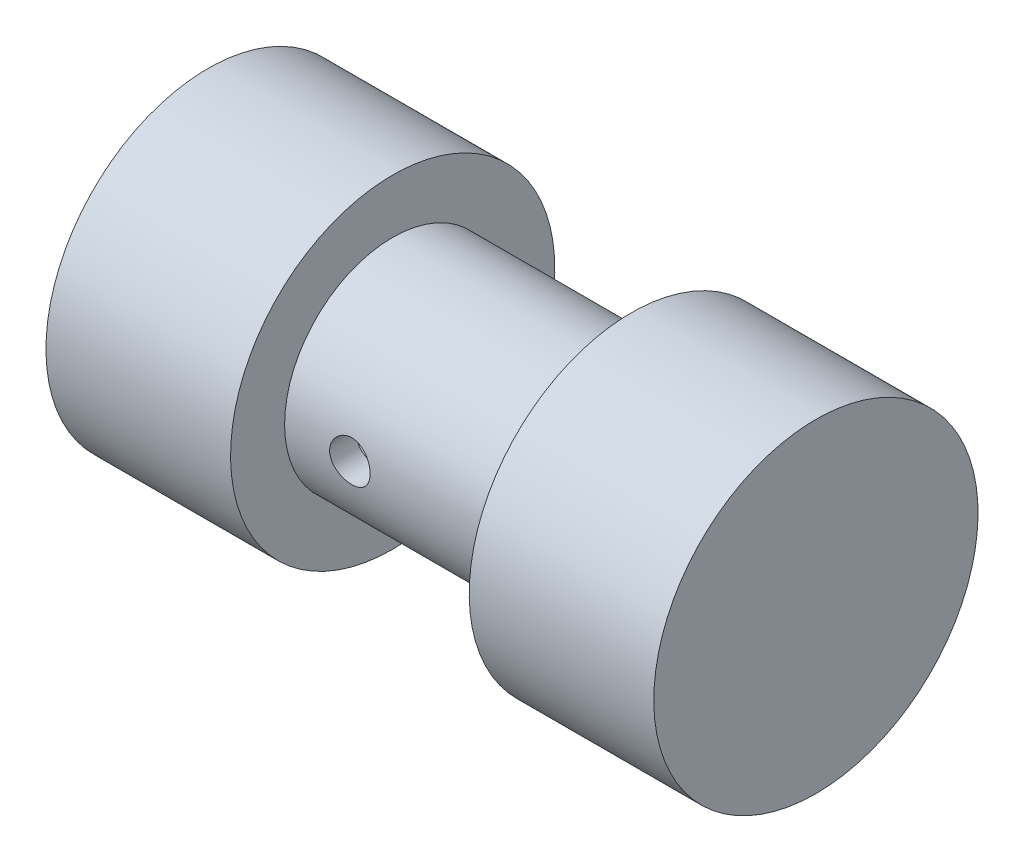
ISO-10303-21;
HEADER;
FILE_DESCRIPTION(('STEP AP214'),'2;1');
FILE_NAME('part.step','',(''),(''),'','','');
FILE_SCHEMA(('AUTOMOTIVE_DESIGN { 1 0 10303 214 1 1 1 1 }'));
ENDSEC;
DATA;
#1=APPLICATION_CONTEXT('core data for automotive mechanical design processes');
#2=APPLICATION_PROTOCOL_DEFINITION('international standard','automotive_design',2000,#1);
#3=PRODUCT_CONTEXT('',#1,'mechanical');
#4=PRODUCT('Part','Part','',(#3));
#5=PRODUCT_RELATED_PRODUCT_CATEGORY('part','',(#4));
#6=PRODUCT_DEFINITION_FORMATION('','',#4);
#7=PRODUCT_DEFINITION_CONTEXT('part definition',#1,'design');
#8=PRODUCT_DEFINITION('design','',#6,#7);
#9=PRODUCT_DEFINITION_SHAPE('','',#8);
#10=(LENGTH_UNIT() NAMED_UNIT(*) SI_UNIT(.MILLI.,.METRE.));
#11=(NAMED_UNIT(*) PLANE_ANGLE_UNIT() SI_UNIT($,.RADIAN.));
#12=(NAMED_UNIT(*) SI_UNIT($,.STERADIAN.) SOLID_ANGLE_UNIT());
#13=UNCERTAINTY_MEASURE_WITH_UNIT(LENGTH_MEASURE(1.E-05),#10,'distance_accuracy_value','');
#14=(GEOMETRIC_REPRESENTATION_CONTEXT(3) GLOBAL_UNCERTAINTY_ASSIGNED_CONTEXT((#13)) GLOBAL_UNIT_ASSIGNED_CONTEXT((#10,
#11,#12)) REPRESENTATION_CONTEXT('',''));
#15=CARTESIAN_POINT('',(0.,0.,0.));
#16=DIRECTION('',(0.,0.,1.));
#17=DIRECTION('',(1.,0.,0.));
#18=AXIS2_PLACEMENT_3D('',#15,#16,#17);
#19=CARTESIAN_POINT('',(0.,0.,0.));
#20=DIRECTION('',(-1.,0.,0.));
#21=DIRECTION('',(0.,-1.,0.));
#22=AXIS2_PLACEMENT_3D('',#19,#20,#21);
#23=CYLINDRICAL_SURFACE('',#22,4.7625);
#24=CARTESIAN_POINT('',(-1.984375,0.,-4.7625));
#25=CARTESIAN_POINT('',(-1.98437684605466,-0.065782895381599,-4.76249888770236));
#26=CARTESIAN_POINT('',(-1.98984516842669,-0.131586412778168,-4.76112346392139));
#27=CARTESIAN_POINT('',(-2.01154121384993,-0.26130751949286,-4.75576990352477));
#28=CARTESIAN_POINT('',(-2.02777503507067,-0.325224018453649,-4.751790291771));
#29=CARTESIAN_POINT('',(-2.07044865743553,-0.44927906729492,-4.74166903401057));
#30=CARTESIAN_POINT('',(-2.09687620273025,-0.509422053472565,-4.73552998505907));
#31=CARTESIAN_POINT('',(-2.15914397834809,-0.624421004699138,-4.72174366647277));
#32=CARTESIAN_POINT('',(-2.19498452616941,-0.679276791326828,-4.71409634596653));
#33=CARTESIAN_POINT('',(-2.27584062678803,-0.783274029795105,-4.69794759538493));
#34=CARTESIAN_POINT('',(-2.32101356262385,-0.832291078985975,-4.68943298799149));
#35=CARTESIAN_POINT('',(-2.41891518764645,-0.922138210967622,-4.6725968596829));
#36=CARTESIAN_POINT('',(-2.47164472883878,-0.962967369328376,-4.66427536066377));
#37=CARTESIAN_POINT('',(-2.58412871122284,-1.03586481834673,-4.64863478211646));
#38=CARTESIAN_POINT('',(-2.64397587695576,-1.06779394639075,-4.64133243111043));
#39=CARTESIAN_POINT('',(-2.76840030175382,-1.12109004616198,-4.62874911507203));
#40=CARTESIAN_POINT('',(-2.83297680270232,-1.14245870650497,-4.62346782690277));
#41=CARTESIAN_POINT('',(-2.96365890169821,-1.17360290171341,-4.61566003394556));
#42=CARTESIAN_POINT('',(-3.02970794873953,-1.18360211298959,-4.6130804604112));
#43=CARTESIAN_POINT('',(-3.16259255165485,-1.19242028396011,-4.61080931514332));
#44=CARTESIAN_POINT('',(-3.22942797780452,-1.19124106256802,-4.61111727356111));
#45=CARTESIAN_POINT('',(-3.36027379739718,-1.17791430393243,-4.61453869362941));
#46=CARTESIAN_POINT('',(-3.42431339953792,-1.16603330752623,-4.61758397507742));
#47=CARTESIAN_POINT('',(-3.54946033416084,-1.13206544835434,-4.62602825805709));
#48=CARTESIAN_POINT('',(-3.61056745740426,-1.1099778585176,-4.63142742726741));
#49=CARTESIAN_POINT('',(-3.72882955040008,-1.05599664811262,-4.64403371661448));
#50=CARTESIAN_POINT('',(-3.78593839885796,-1.02400629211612,-4.65125853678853));
#51=CARTESIAN_POINT('',(-3.89407297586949,-0.95119529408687,-4.66669207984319));
#52=CARTESIAN_POINT('',(-3.94509763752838,-0.910373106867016,-4.67490097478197));
#53=CARTESIAN_POINT('',(-4.04114286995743,-0.819676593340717,-4.69166480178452));
#54=CARTESIAN_POINT('',(-4.0859507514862,-0.769577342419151,-4.7002229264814));
#55=CARTESIAN_POINT('',(-4.16656936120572,-0.662473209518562,-4.71650985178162));
#56=CARTESIAN_POINT('',(-4.2023798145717,-0.60546811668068,-4.72423862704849));
#57=CARTESIAN_POINT('',(-4.26406515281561,-0.485866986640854,-4.73803449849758));
#58=CARTESIAN_POINT('',(-4.28990548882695,-0.423252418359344,-4.74409579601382));
#59=CARTESIAN_POINT('',(-4.33063436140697,-0.294382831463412,-4.75383159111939));
#60=CARTESIAN_POINT('',(-4.3455249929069,-0.228128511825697,-4.75750654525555));
#61=CARTESIAN_POINT('',(-4.36360694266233,-0.0956786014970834,-4.76198802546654));
#62=CARTESIAN_POINT('',(-4.36708790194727,-0.0295248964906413,-4.76286554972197));
#63=CARTESIAN_POINT('',(-4.36304610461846,0.102419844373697,-4.76185551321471));
#64=CARTESIAN_POINT('',(-4.35552433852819,0.168210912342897,-4.75996820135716));
#65=CARTESIAN_POINT('',(-4.32992934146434,0.29655632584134,-4.7536860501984));
#66=CARTESIAN_POINT('',(-4.31201412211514,0.359144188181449,-4.74932878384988));
#67=CARTESIAN_POINT('',(-4.26632125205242,0.480422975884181,-4.73859785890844));
#68=CARTESIAN_POINT('',(-4.23854260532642,0.539113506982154,-4.73222399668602));
#69=CARTESIAN_POINT('',(-4.17335007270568,0.652083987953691,-4.71799688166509));
#70=CARTESIAN_POINT('',(-4.13577396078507,0.70626719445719,-4.71011938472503));
#71=CARTESIAN_POINT('',(-4.0522605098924,0.807661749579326,-4.69379704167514));
#72=CARTESIAN_POINT('',(-4.00632172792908,0.854871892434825,-4.68535209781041));
#73=CARTESIAN_POINT('',(-3.90604219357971,0.94217376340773,-4.66859109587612));
#74=CARTESIAN_POINT('',(-3.85152288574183,0.982062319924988,-4.66028328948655));
#75=CARTESIAN_POINT('',(-3.73639347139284,1.05212416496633,-4.64496847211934));
#76=CARTESIAN_POINT('',(-3.6757836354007,1.08229788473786,-4.63796140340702));
#77=CARTESIAN_POINT('',(-3.55051858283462,1.13184894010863,-4.62611862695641));
#78=CARTESIAN_POINT('',(-3.48588994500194,1.15129023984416,-4.62127008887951));
#79=CARTESIAN_POINT('',(-3.35414172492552,1.17899311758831,-4.61428103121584));
#80=CARTESIAN_POINT('',(-3.28702269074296,1.18725714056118,-4.612139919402));
#81=CARTESIAN_POINT('',(-3.15426643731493,1.19224313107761,-4.61085327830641));
#82=CARTESIAN_POINT('',(-3.08864203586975,1.18928983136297,-4.6116234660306));
#83=CARTESIAN_POINT('',(-2.95885878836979,1.17266821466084,-4.61587777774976));
#84=CARTESIAN_POINT('',(-2.89469991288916,1.15900011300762,-4.61936184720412));
#85=CARTESIAN_POINT('',(-2.77002203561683,1.12151423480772,-4.62860438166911));
#86=CARTESIAN_POINT('',(-2.70948363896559,1.09775736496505,-4.63434918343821));
#87=CARTESIAN_POINT('',(-2.59320872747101,1.04081652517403,-4.64746781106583));
#88=CARTESIAN_POINT('',(-2.53747288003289,1.00763124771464,-4.65484186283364));
#89=CARTESIAN_POINT('',(-2.43081601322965,0.931757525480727,-4.67062847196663));
#90=CARTESIAN_POINT('',(-2.38005852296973,0.888843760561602,-4.67906310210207));
#91=CARTESIAN_POINT('',(-2.28635953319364,0.795170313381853,-4.6958887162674));
#92=CARTESIAN_POINT('',(-2.24341989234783,0.744408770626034,-4.70427968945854));
#93=CARTESIAN_POINT('',(-2.16581727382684,0.635371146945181,-4.72025389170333));
#94=CARTESIAN_POINT('',(-2.13131827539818,0.576975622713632,-4.72781973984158));
#95=CARTESIAN_POINT('',(-2.07268170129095,0.45502993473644,-4.74110784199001));
#96=CARTESIAN_POINT('',(-2.04853670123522,0.391483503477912,-4.74683141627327));
#97=CARTESIAN_POINT('',(-2.01487735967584,0.273375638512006,-4.75494397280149));
#98=CARTESIAN_POINT('',(-2.00346370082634,0.21937676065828,-4.75775801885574));
#99=CARTESIAN_POINT('',(-1.98821203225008,0.110256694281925,-4.76153642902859));
#100=CARTESIAN_POINT('',(-1.98437345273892,0.0551355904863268,-4.76250093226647));
#101=CARTESIAN_POINT('',(-1.984375,0.,-4.7625));
#102=B_SPLINE_CURVE_WITH_KNOTS('',3,(#24,#25,#26,#27,#28,#29,#30,#31,#32,#33,#34,#35,#36,#37,
#38,#39,#40,#41,#42,#43,#44,#45,#46,#47,#48,#49,#50,#51,#52,#53,#54,#55,#56,#57,#58,#59,#60,#61,
#62,#63,#64,#65,#66,#67,#68,#69,#70,#71,#72,#73,#74,#75,#76,#77,#78,#79,#80,#81,#82,#83,#84,#85,
#86,#87,#88,#89,#90,#91,#92,#93,#94,#95,#96,#97,#98,#99,#100,#101),.UNSPECIFIED.,.T.,.F.,(4,2,2,
2,2,2,2,2,2,2,2,2,2,2,2,2,2,2,2,2,2,2,2,2,2,2,2,2,2,2,2,2,2,2,2,2,2,2,4),(0.,0.197146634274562,
0.394405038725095,0.591427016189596,0.788455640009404,0.98912708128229,1.18982116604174,
1.39349676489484,1.59713978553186,1.79670309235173,1.99623392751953,2.19092856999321,
2.38563708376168,2.58231106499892,2.77901948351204,2.98133691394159,3.18366052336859,
3.38667906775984,3.5896587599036,3.78744407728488,3.9852115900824,4.18004842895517,
4.37490494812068,4.57321910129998,4.77156750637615,4.97478454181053,5.17799255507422,
5.37997602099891,5.58191529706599,5.77805375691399,5.97418827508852,6.16915517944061,
6.36414913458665,6.56422976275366,6.76435789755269,6.96811047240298,7.17171670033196,
7.33696655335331,7.50220397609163),.UNSPECIFIED.);
#103=CARTESIAN_POINT('',(-1.984375,0.,-4.7625));
#104=VERTEX_POINT('',#103);
#105=EDGE_CURVE('E77',#104,#104,#102,.T.);
#106=ORIENTED_EDGE('',*,*,#105,.T.);
#107=EDGE_LOOP('',(#106));
#108=FACE_BOUND('',#107,.T.);
#109=CARTESIAN_POINT('',(-1.984375,0.,4.7625));
#110=CARTESIAN_POINT('',(-1.98437684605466,0.065782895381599,4.76249888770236));
#111=CARTESIAN_POINT('',(-1.98984516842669,0.131586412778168,4.76112346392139));
#112=CARTESIAN_POINT('',(-2.01154121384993,0.26130751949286,4.75576990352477));
#113=CARTESIAN_POINT('',(-2.02777503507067,0.325224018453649,4.751790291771));
#114=CARTESIAN_POINT('',(-2.07044865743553,0.44927906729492,4.74166903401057));
#115=CARTESIAN_POINT('',(-2.09687620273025,0.509422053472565,4.73552998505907));
#116=CARTESIAN_POINT('',(-2.15914397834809,0.624421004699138,4.72174366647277));
#117=CARTESIAN_POINT('',(-2.19498452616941,0.679276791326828,4.71409634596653));
#118=CARTESIAN_POINT('',(-2.27584062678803,0.783274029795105,4.69794759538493));
#119=CARTESIAN_POINT('',(-2.32101356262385,0.832291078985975,4.68943298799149));
#120=CARTESIAN_POINT('',(-2.41891518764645,0.922138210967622,4.6725968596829));
#121=CARTESIAN_POINT('',(-2.47164472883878,0.962967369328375,4.66427536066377));
#122=CARTESIAN_POINT('',(-2.58412871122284,1.03586481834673,4.64863478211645));
#123=CARTESIAN_POINT('',(-2.64397587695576,1.06779394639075,4.64133243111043));
#124=CARTESIAN_POINT('',(-2.76840030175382,1.12109004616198,4.62874911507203));
#125=CARTESIAN_POINT('',(-2.83297680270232,1.14245870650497,4.62346782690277));
#126=CARTESIAN_POINT('',(-2.96365890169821,1.17360290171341,4.61566003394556));
#127=CARTESIAN_POINT('',(-3.02970794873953,1.18360211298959,4.6130804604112));
#128=CARTESIAN_POINT('',(-3.16259255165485,1.19242028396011,4.61080931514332));
#129=CARTESIAN_POINT('',(-3.22942797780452,1.19124106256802,4.61111727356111));
#130=CARTESIAN_POINT('',(-3.36027379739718,1.17791430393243,4.61453869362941));
#131=CARTESIAN_POINT('',(-3.42431339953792,1.16603330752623,4.61758397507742));
#132=CARTESIAN_POINT('',(-3.54946033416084,1.13206544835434,4.62602825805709));
#133=CARTESIAN_POINT('',(-3.61056745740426,1.1099778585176,4.63142742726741));
#134=CARTESIAN_POINT('',(-3.72882955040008,1.05599664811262,4.64403371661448));
#135=CARTESIAN_POINT('',(-3.78593839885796,1.02400629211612,4.65125853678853));
#136=CARTESIAN_POINT('',(-3.89407297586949,0.95119529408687,4.66669207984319));
#137=CARTESIAN_POINT('',(-3.94509763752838,0.910373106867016,4.67490097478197));
#138=CARTESIAN_POINT('',(-4.04114286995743,0.819676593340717,4.69166480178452));
#139=CARTESIAN_POINT('',(-4.0859507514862,0.769577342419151,4.7002229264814));
#140=CARTESIAN_POINT('',(-4.16656936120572,0.662473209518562,4.71650985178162));
#141=CARTESIAN_POINT('',(-4.2023798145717,0.60546811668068,4.72423862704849));
#142=CARTESIAN_POINT('',(-4.26406515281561,0.485866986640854,4.73803449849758));
#143=CARTESIAN_POINT('',(-4.28990548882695,0.423252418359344,4.74409579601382));
#144=CARTESIAN_POINT('',(-4.33063436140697,0.294382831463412,4.75383159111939));
#145=CARTESIAN_POINT('',(-4.3455249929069,0.228128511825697,4.75750654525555));
#146=CARTESIAN_POINT('',(-4.36360694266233,0.0956786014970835,4.76198802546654));
#147=CARTESIAN_POINT('',(-4.36708790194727,0.0295248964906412,4.76286554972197));
#148=CARTESIAN_POINT('',(-4.36304610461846,-0.102419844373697,4.76185551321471));
#149=CARTESIAN_POINT('',(-4.35552433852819,-0.168210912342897,4.75996820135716));
#150=CARTESIAN_POINT('',(-4.32992934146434,-0.29655632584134,4.7536860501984));
#151=CARTESIAN_POINT('',(-4.31201412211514,-0.359144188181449,4.74932878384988));
#152=CARTESIAN_POINT('',(-4.26632125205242,-0.480422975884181,4.73859785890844));
#153=CARTESIAN_POINT('',(-4.23854260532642,-0.539113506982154,4.73222399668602));
#154=CARTESIAN_POINT('',(-4.17335007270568,-0.652083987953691,4.71799688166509));
#155=CARTESIAN_POINT('',(-4.13577396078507,-0.70626719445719,4.71011938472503));
#156=CARTESIAN_POINT('',(-4.0522605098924,-0.807661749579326,4.69379704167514));
#157=CARTESIAN_POINT('',(-4.00632172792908,-0.854871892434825,4.68535209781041));
#158=CARTESIAN_POINT('',(-3.90604219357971,-0.94217376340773,4.66859109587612));
#159=CARTESIAN_POINT('',(-3.85152288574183,-0.982062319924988,4.66028328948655));
#160=CARTESIAN_POINT('',(-3.73639347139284,-1.05212416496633,4.64496847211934));
#161=CARTESIAN_POINT('',(-3.6757836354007,-1.08229788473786,4.63796140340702));
#162=CARTESIAN_POINT('',(-3.55051858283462,-1.13184894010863,4.62611862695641));
#163=CARTESIAN_POINT('',(-3.48588994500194,-1.15129023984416,4.6212700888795));
#164=CARTESIAN_POINT('',(-3.35414172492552,-1.17899311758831,4.61428103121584));
#165=CARTESIAN_POINT('',(-3.28702269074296,-1.18725714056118,4.612139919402));
#166=CARTESIAN_POINT('',(-3.15426643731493,-1.19224313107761,4.61085327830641));
#167=CARTESIAN_POINT('',(-3.08864203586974,-1.18928983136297,4.6116234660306));
#168=CARTESIAN_POINT('',(-2.95885878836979,-1.17266821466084,4.61587777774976));
#169=CARTESIAN_POINT('',(-2.89469991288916,-1.15900011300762,4.61936184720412));
#170=CARTESIAN_POINT('',(-2.77002203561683,-1.12151423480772,4.62860438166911));
#171=CARTESIAN_POINT('',(-2.70948363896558,-1.09775736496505,4.63434918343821));
#172=CARTESIAN_POINT('',(-2.59320872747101,-1.04081652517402,4.64746781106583));
#173=CARTESIAN_POINT('',(-2.53747288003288,-1.00763124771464,4.65484186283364));
#174=CARTESIAN_POINT('',(-2.43081601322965,-0.931757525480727,4.67062847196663));
#175=CARTESIAN_POINT('',(-2.38005852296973,-0.888843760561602,4.67906310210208));
#176=CARTESIAN_POINT('',(-2.28635953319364,-0.795170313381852,4.6958887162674));
#177=CARTESIAN_POINT('',(-2.24341989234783,-0.744408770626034,4.70427968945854));
#178=CARTESIAN_POINT('',(-2.16581727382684,-0.63537114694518,4.72025389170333));
#179=CARTESIAN_POINT('',(-2.13131827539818,-0.576975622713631,4.72781973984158));
#180=CARTESIAN_POINT('',(-2.07268170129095,-0.45502993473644,4.74110784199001));
#181=CARTESIAN_POINT('',(-2.04853670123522,-0.391483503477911,4.74683141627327));
#182=CARTESIAN_POINT('',(-2.01487735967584,-0.273375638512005,4.75494397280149));
#183=CARTESIAN_POINT('',(-2.00346370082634,-0.219376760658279,4.75775801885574));
#184=CARTESIAN_POINT('',(-1.98821203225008,-0.110256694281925,4.76153642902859));
#185=CARTESIAN_POINT('',(-1.98437345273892,-0.0551355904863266,4.76250093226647));
#186=CARTESIAN_POINT('',(-1.984375,0.,4.7625));
#187=B_SPLINE_CURVE_WITH_KNOTS('',3,(#109,#110,#111,#112,#113,#114,#115,#116,#117,#118,#119,
#120,#121,#122,#123,#124,#125,#126,#127,#128,#129,#130,#131,#132,#133,#134,#135,#136,#137,#138,
#139,#140,#141,#142,#143,#144,#145,#146,#147,#148,#149,#150,#151,#152,#153,#154,#155,#156,#157,
#158,#159,#160,#161,#162,#163,#164,#165,#166,#167,#168,#169,#170,#171,#172,#173,#174,#175,#176,
#177,#178,#179,#180,#181,#182,#183,#184,#185,#186),.UNSPECIFIED.,.T.,.F.,(4,2,2,2,2,2,2,2,2,2,2,
2,2,2,2,2,2,2,2,2,2,2,2,2,2,2,2,2,2,2,2,2,2,2,2,2,2,2,4),(0.,0.197146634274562,
0.394405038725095,0.591427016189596,0.788455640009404,0.98912708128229,1.18982116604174,
1.39349676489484,1.59713978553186,1.79670309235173,1.99623392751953,2.19092856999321,
2.38563708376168,2.58231106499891,2.77901948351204,2.98133691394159,3.18366052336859,
3.38667906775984,3.5896587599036,3.78744407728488,3.9852115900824,4.18004842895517,
4.37490494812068,4.57321910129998,4.77156750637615,4.97478454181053,5.17799255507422,
5.37997602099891,5.58191529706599,5.77805375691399,5.97418827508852,6.16915517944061,
6.36414913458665,6.56422976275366,6.76435789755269,6.96811047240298,7.17171670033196,
7.33696655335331,7.50220397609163),.UNSPECIFIED.);
#188=CARTESIAN_POINT('',(-1.984375,0.,4.7625));
#189=VERTEX_POINT('',#188);
#190=EDGE_CURVE('E73',#189,#189,#187,.T.);
#191=ORIENTED_EDGE('',*,*,#190,.T.);
#192=EDGE_LOOP('',(#191));
#193=FACE_BOUND('',#192,.T.);
#194=CARTESIAN_POINT('',(1.1938,0.,0.));
#195=DIRECTION('',(-1.,0.,0.));
#196=DIRECTION('',(0.,-1.,0.));
#197=AXIS2_PLACEMENT_3D('',#194,#195,#196);
#198=CIRCLE('',#197,4.76250000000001);
#199=CARTESIAN_POINT('',(1.1938,-4.76250000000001,0.));
#200=VERTEX_POINT('',#199);
#201=EDGE_CURVE('E82',#200,#200,#198,.T.);
#202=ORIENTED_EDGE('',*,*,#201,.F.);
#203=EDGE_LOOP('',(#202));
#204=FACE_BOUND('',#203,.T.);
#205=CARTESIAN_POINT('',(-17.8562,0.,0.));
#206=DIRECTION('',(-1.,0.,0.));
#207=DIRECTION('',(0.,-1.,0.));
#208=AXIS2_PLACEMENT_3D('',#205,#206,#207);
#209=CIRCLE('',#208,4.7625);
#210=CARTESIAN_POINT('',(-17.8562,-4.7625,0.));
#211=VERTEX_POINT('',#210);
#212=EDGE_CURVE('E10',#211,#211,#209,.T.);
#213=ORIENTED_EDGE('',*,*,#212,.T.);
#214=EDGE_LOOP('',(#213));
#215=FACE_BOUND('',#214,.T.);
#216=ADVANCED_FACE('F32',(#108,#193,#204,#215),#23,.F.);
#217=CARTESIAN_POINT('',(-17.8562,9.52499999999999,0.));
#218=DIRECTION('',(1.,0.,0.));
#219=DIRECTION('',(0.,1.,0.));
#220=AXIS2_PLACEMENT_3D('',#217,#218,#219);
#221=PLANE('',#220);
#222=ORIENTED_EDGE('',*,*,#212,.F.);
#223=EDGE_LOOP('',(#222));
#224=FACE_BOUND('',#223,.T.);
#225=CARTESIAN_POINT('',(-17.8562,0.,0.));
#226=DIRECTION('',(-1.,0.,0.));
#227=DIRECTION('',(0.,-1.,0.));
#228=AXIS2_PLACEMENT_3D('',#225,#226,#227);
#229=CIRCLE('',#228,9.52499999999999);
#230=CARTESIAN_POINT('',(-17.8562,-9.52499999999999,0.));
#231=VERTEX_POINT('',#230);
#232=EDGE_CURVE('E44',#231,#231,#229,.T.);
#233=ORIENTED_EDGE('',*,*,#232,.T.);
#234=EDGE_LOOP('',(#233));
#235=FACE_BOUND('',#234,.T.);
#236=ADVANCED_FACE('F129',(#224,#235),#221,.F.);
#237=CARTESIAN_POINT('',(0.,0.,0.));
#238=DIRECTION('',(-1.,0.,0.));
#239=DIRECTION('',(0.,-1.,0.));
#240=AXIS2_PLACEMENT_3D('',#237,#238,#239);
#241=CYLINDRICAL_SURFACE('',#240,9.52499999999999);
#242=ORIENTED_EDGE('',*,*,#232,.F.);
#243=EDGE_LOOP('',(#242));
#244=FACE_BOUND('',#243,.T.);
#245=CARTESIAN_POINT('',(-7.0104,0.,0.));
#246=DIRECTION('',(-1.,0.,0.));
#247=DIRECTION('',(0.,-1.,0.));
#248=AXIS2_PLACEMENT_3D('',#245,#246,#247);
#249=CIRCLE('',#248,9.52499999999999);
#250=CARTESIAN_POINT('',(-7.0104,-9.52499999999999,0.));
#251=VERTEX_POINT('',#250);
#252=EDGE_CURVE('E49',#251,#251,#249,.T.);
#253=ORIENTED_EDGE('',*,*,#252,.T.);
#254=EDGE_LOOP('',(#253));
#255=FACE_BOUND('',#254,.T.);
#256=ADVANCED_FACE('F99',(#244,#255),#241,.T.);
#257=CARTESIAN_POINT('',(-7.0104,6.35,0.));
#258=DIRECTION('',(-1.,0.,0.));
#259=DIRECTION('',(0.,-1.,0.));
#260=AXIS2_PLACEMENT_3D('',#257,#258,#259);
#261=PLANE('',#260);
#262=ORIENTED_EDGE('',*,*,#252,.F.);
#263=EDGE_LOOP('',(#262));
#264=FACE_BOUND('',#263,.T.);
#265=CARTESIAN_POINT('',(-7.0104,0.,0.));
#266=DIRECTION('',(-1.,0.,0.));
#267=DIRECTION('',(0.,-1.,0.));
#268=AXIS2_PLACEMENT_3D('',#265,#266,#267);
#269=CIRCLE('',#268,6.35);
#270=CARTESIAN_POINT('',(-7.0104,-6.35,0.));
#271=VERTEX_POINT('',#270);
#272=EDGE_CURVE('E94',#271,#271,#269,.T.);
#273=ORIENTED_EDGE('',*,*,#272,.T.);
#274=EDGE_LOOP('',(#273));
#275=FACE_BOUND('',#274,.T.);
#276=ADVANCED_FACE('F101',(#264,#275),#261,.F.);
#277=CARTESIAN_POINT('',(0.,0.,0.));
#278=DIRECTION('',(-1.,0.,0.));
#279=DIRECTION('',(0.,-1.,0.));
#280=AXIS2_PLACEMENT_3D('',#277,#278,#279);
#281=CYLINDRICAL_SURFACE('',#280,6.35);
#282=CARTESIAN_POINT('',(-1.984375,0.,-6.35));
#283=CARTESIAN_POINT('',(-1.98437753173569,0.0662556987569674,-6.3499988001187));
#284=CARTESIAN_POINT('',(-1.98992416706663,0.132544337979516,-6.3489523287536));
#285=CARTESIAN_POINT('',(-2.01194987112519,0.263253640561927,-6.344878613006));
#286=CARTESIAN_POINT('',(-2.02843816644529,0.327672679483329,-6.34184969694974));
#287=CARTESIAN_POINT('',(-2.0718245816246,0.452733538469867,-6.33414991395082));
#288=CARTESIAN_POINT('',(-2.09871330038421,0.513378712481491,-6.3294805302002));
#289=CARTESIAN_POINT('',(-2.16211060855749,0.629291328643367,-6.31900970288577));
#290=CARTESIAN_POINT('',(-2.1986184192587,0.684559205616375,-6.31320835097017));
#291=CARTESIAN_POINT('',(-2.28068169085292,0.788815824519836,-6.30103623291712));
#292=CARTESIAN_POINT('',(-2.32632999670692,0.837730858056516,-6.29466002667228));
#293=CARTESIAN_POINT('',(-2.42517875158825,0.927255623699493,-6.28209721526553));
#294=CARTESIAN_POINT('',(-2.47837974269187,0.967864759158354,-6.27591062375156));
#295=CARTESIAN_POINT('',(-2.5913445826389,1.03993155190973,-6.26437462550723));
#296=CARTESIAN_POINT('',(-2.65115704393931,1.07131423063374,-6.25903223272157));
#297=CARTESIAN_POINT('',(-2.77532220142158,1.1235572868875,-6.24986616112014));
#298=CARTESIAN_POINT('',(-2.83967450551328,1.14441857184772,-6.24604235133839));
#299=CARTESIAN_POINT('',(-2.97030396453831,1.17479011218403,-6.24040113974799));
#300=CARTESIAN_POINT('',(-3.03655023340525,1.18442890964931,-6.23856103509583));
#301=CARTESIAN_POINT('',(-3.16974329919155,1.19248085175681,-6.23702712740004));
#302=CARTESIAN_POINT('',(-3.23669003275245,1.19089500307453,-6.2373331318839));
#303=CARTESIAN_POINT('',(-3.36845237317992,1.17664690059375,-6.24003619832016));
#304=CARTESIAN_POINT('',(-3.43328443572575,1.16413081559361,-6.24240566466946));
#305=CARTESIAN_POINT('',(-3.55991193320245,1.12860772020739,-6.24892532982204));
#306=CARTESIAN_POINT('',(-3.62170723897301,1.10560026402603,-6.25307560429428));
#307=CARTESIAN_POINT('',(-3.74093476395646,1.04960457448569,-6.26271810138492));
#308=CARTESIAN_POINT('',(-3.79833859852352,1.01655731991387,-6.26821822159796));
#309=CARTESIAN_POINT('',(-3.90684125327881,0.941461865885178,-6.27993546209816));
#310=CARTESIAN_POINT('',(-3.95793943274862,0.899412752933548,-6.2861526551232));
#311=CARTESIAN_POINT('',(-4.05322480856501,0.80671912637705,-6.2987237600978));
#312=CARTESIAN_POINT('',(-4.09729039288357,0.755949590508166,-6.30507828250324));
#313=CARTESIAN_POINT('',(-4.1762975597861,0.647674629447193,-6.31711800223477));
#314=CARTESIAN_POINT('',(-4.2112390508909,0.590169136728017,-6.32280319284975));
#315=CARTESIAN_POINT('',(-4.27102409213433,0.469927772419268,-6.33287515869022));
#316=CARTESIAN_POINT('',(-4.29585499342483,0.407185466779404,-6.33726030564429));
#317=CARTESIAN_POINT('',(-4.3345910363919,0.278319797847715,-6.34422551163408));
#318=CARTESIAN_POINT('',(-4.348497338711,0.212196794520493,-6.34680576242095));
#319=CARTESIAN_POINT('',(-4.36482016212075,0.0794929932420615,-6.34984411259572));
#320=CARTESIAN_POINT('',(-4.36740331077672,0.0129333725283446,-6.35033298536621));
#321=CARTESIAN_POINT('',(-4.36145346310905,-0.119666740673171,-6.34921850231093));
#322=CARTESIAN_POINT('',(-4.35292101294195,-0.185707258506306,-6.34761524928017));
#323=CARTESIAN_POINT('',(-4.3251207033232,-0.31486599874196,-6.34251582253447));
#324=CARTESIAN_POINT('',(-4.30593715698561,-0.378003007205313,-6.33903452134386));
#325=CARTESIAN_POINT('',(-4.25747044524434,-0.500164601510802,-6.3305677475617));
#326=CARTESIAN_POINT('',(-4.22818659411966,-0.559188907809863,-6.32558217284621));
#327=CARTESIAN_POINT('',(-4.15998173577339,-0.672160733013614,-6.31458311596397));
#328=CARTESIAN_POINT('',(-4.12095891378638,-0.726045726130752,-6.30855899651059));
#329=CARTESIAN_POINT('',(-4.03452160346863,-0.826562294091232,-6.29617853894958));
#330=CARTESIAN_POINT('',(-3.98710633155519,-0.873193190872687,-6.2898221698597));
#331=CARTESIAN_POINT('',(-3.88447572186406,-0.95851103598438,-6.27739152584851));
#332=CARTESIAN_POINT('',(-3.82916516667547,-0.997084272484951,-6.27132211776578));
#333=CARTESIAN_POINT('',(-3.71275163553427,-1.06439235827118,-6.26025057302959));
#334=CARTESIAN_POINT('',(-3.65164887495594,-1.09312757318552,-6.25524839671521));
#335=CARTESIAN_POINT('',(-3.52567409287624,-1.13978272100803,-6.24691587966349));
#336=CARTESIAN_POINT('',(-3.46082192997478,-1.15775477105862,-6.24357749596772));
#337=CARTESIAN_POINT('',(-3.32895001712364,-1.18253414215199,-6.23893218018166));
#338=CARTESIAN_POINT('',(-3.26193051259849,-1.18934272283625,-6.2376250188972));
#339=CARTESIAN_POINT('',(-3.1287653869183,-1.19155973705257,-6.23720177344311));
#340=CARTESIAN_POINT('',(-3.06262279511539,-1.18714754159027,-6.23805121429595));
#341=CARTESIAN_POINT('',(-2.93203993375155,-1.16744095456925,-6.24176901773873));
#342=CARTESIAN_POINT('',(-2.86759965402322,-1.15214662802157,-6.24463736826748));
#343=CARTESIAN_POINT('',(-2.74234712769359,-1.11118560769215,-6.25205528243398));
#344=CARTESIAN_POINT('',(-2.6815283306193,-1.08553833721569,-6.25660169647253));
#345=CARTESIAN_POINT('',(-2.56502832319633,-1.02461908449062,-6.26686570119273));
#346=CARTESIAN_POINT('',(-2.50934747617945,-0.989346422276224,-6.27258337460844));
#347=CARTESIAN_POINT('',(-2.40380545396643,-0.909554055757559,-6.28465267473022));
#348=CARTESIAN_POINT('',(-2.35404389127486,-0.864903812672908,-6.29101251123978));
#349=CARTESIAN_POINT('',(-2.26265965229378,-0.767895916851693,-6.30358811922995));
#350=CARTESIAN_POINT('',(-2.22103884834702,-0.71553649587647,-6.30980385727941));
#351=CARTESIAN_POINT('',(-2.14676755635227,-0.604031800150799,-6.32145655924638));
#352=CARTESIAN_POINT('',(-2.11420120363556,-0.54482967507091,-6.32688600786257));
#353=CARTESIAN_POINT('',(-2.05952912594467,-0.42171152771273,-6.3362809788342));
#354=CARTESIAN_POINT('',(-2.03741357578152,-0.35779999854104,-6.34024787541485));
#355=CARTESIAN_POINT('',(-2.00876113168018,-0.244750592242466,-6.34546205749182));
#356=CARTESIAN_POINT('',(-1.99963196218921,-0.196273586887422,-6.34715417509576));
#357=CARTESIAN_POINT('',(-1.98743803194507,-0.0985371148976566,-6.34942357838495));
#358=CARTESIAN_POINT('',(-1.98437311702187,-0.0492776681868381,-6.35000089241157));
#359=CARTESIAN_POINT('',(-1.984375,0.,-6.35));
#360=B_SPLINE_CURVE_WITH_KNOTS('',3,(#282,#283,#284,#285,#286,#287,#288,#289,#290,#291,#292,
#293,#294,#295,#296,#297,#298,#299,#300,#301,#302,#303,#304,#305,#306,#307,#308,#309,#310,#311,
#312,#313,#314,#315,#316,#317,#318,#319,#320,#321,#322,#323,#324,#325,#326,#327,#328,#329,#330,
#331,#332,#333,#334,#335,#336,#337,#338,#339,#340,#341,#342,#343,#344,#345,#346,#347,#348,#349,
#350,#351,#352,#353,#354,#355,#356,#357,#358,#359),.UNSPECIFIED.,.T.,.F.,(4,2,2,2,2,2,2,2,2,2,2,
2,2,2,2,2,2,2,2,2,2,2,2,2,2,2,2,2,2,2,2,2,2,2,2,2,2,2,4),(0.,0.198586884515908,
0.397341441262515,0.595916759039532,0.79447600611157,0.995164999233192,1.19586840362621,
1.39816038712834,1.60043492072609,1.80036907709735,2.00028530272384,2.19756831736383,
2.39485971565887,2.5933341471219,2.79182872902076,2.99345166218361,3.19507661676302,
3.39695304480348,3.59880802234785,3.79768238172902,3.99654696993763,4.19385935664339,
4.39118514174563,4.59066723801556,4.79016796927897,4.99231790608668,5.19446032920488,
5.39561585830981,5.59674868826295,5.7946865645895,5.99262325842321,6.19019031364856,
6.38777132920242,6.58831049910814,6.78889573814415,6.99128688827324,7.19348738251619,
7.3411901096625,7.48888908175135),.UNSPECIFIED.);
#361=CARTESIAN_POINT('',(-1.984375,0.,-6.35));
#362=VERTEX_POINT('',#361);
#363=EDGE_CURVE('E36',#362,#362,#360,.T.);
#364=ORIENTED_EDGE('',*,*,#363,.T.);
#365=EDGE_LOOP('',(#364));
#366=FACE_BOUND('',#365,.T.);
#367=CARTESIAN_POINT('',(-1.984375,0.,6.35));
#368=CARTESIAN_POINT('',(-1.98437753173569,-0.0662556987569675,6.3499988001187));
#369=CARTESIAN_POINT('',(-1.98992416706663,-0.132544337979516,6.3489523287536));
#370=CARTESIAN_POINT('',(-2.01194987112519,-0.263253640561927,6.344878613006));
#371=CARTESIAN_POINT('',(-2.02843816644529,-0.327672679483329,6.34184969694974));
#372=CARTESIAN_POINT('',(-2.0718245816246,-0.452733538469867,6.33414991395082));
#373=CARTESIAN_POINT('',(-2.09871330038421,-0.513378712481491,6.3294805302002));
#374=CARTESIAN_POINT('',(-2.16211060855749,-0.629291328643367,6.31900970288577));
#375=CARTESIAN_POINT('',(-2.1986184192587,-0.684559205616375,6.31320835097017));
#376=CARTESIAN_POINT('',(-2.28068169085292,-0.788815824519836,6.30103623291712));
#377=CARTESIAN_POINT('',(-2.32632999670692,-0.837730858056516,6.29466002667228));
#378=CARTESIAN_POINT('',(-2.42517875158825,-0.927255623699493,6.28209721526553));
#379=CARTESIAN_POINT('',(-2.47837974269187,-0.967864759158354,6.27591062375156));
#380=CARTESIAN_POINT('',(-2.5913445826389,-1.03993155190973,6.26437462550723));
#381=CARTESIAN_POINT('',(-2.65115704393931,-1.07131423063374,6.25903223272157));
#382=CARTESIAN_POINT('',(-2.77532220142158,-1.1235572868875,6.24986616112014));
#383=CARTESIAN_POINT('',(-2.83967450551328,-1.14441857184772,6.24604235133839));
#384=CARTESIAN_POINT('',(-2.97030396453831,-1.17479011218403,6.24040113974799));
#385=CARTESIAN_POINT('',(-3.03655023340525,-1.18442890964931,6.23856103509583));
#386=CARTESIAN_POINT('',(-3.16974329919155,-1.19248085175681,6.23702712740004));
#387=CARTESIAN_POINT('',(-3.23669003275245,-1.19089500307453,6.2373331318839));
#388=CARTESIAN_POINT('',(-3.36845237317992,-1.17664690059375,6.24003619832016));
#389=CARTESIAN_POINT('',(-3.43328443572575,-1.16413081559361,6.24240566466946));
#390=CARTESIAN_POINT('',(-3.55991193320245,-1.12860772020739,6.24892532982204));
#391=CARTESIAN_POINT('',(-3.62170723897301,-1.10560026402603,6.25307560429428));
#392=CARTESIAN_POINT('',(-3.74093476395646,-1.04960457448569,6.26271810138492));
#393=CARTESIAN_POINT('',(-3.79833859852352,-1.01655731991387,6.26821822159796));
#394=CARTESIAN_POINT('',(-3.90684125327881,-0.941461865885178,6.27993546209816));
#395=CARTESIAN_POINT('',(-3.95793943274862,-0.899412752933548,6.2861526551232));
#396=CARTESIAN_POINT('',(-4.05322480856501,-0.80671912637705,6.2987237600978));
#397=CARTESIAN_POINT('',(-4.09729039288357,-0.755949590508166,6.30507828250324));
#398=CARTESIAN_POINT('',(-4.1762975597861,-0.647674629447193,6.31711800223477));
#399=CARTESIAN_POINT('',(-4.2112390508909,-0.590169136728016,6.32280319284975));
#400=CARTESIAN_POINT('',(-4.27102409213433,-0.469927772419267,6.33287515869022));
#401=CARTESIAN_POINT('',(-4.29585499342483,-0.407185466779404,6.33726030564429));
#402=CARTESIAN_POINT('',(-4.3345910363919,-0.278319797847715,6.34422551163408));
#403=CARTESIAN_POINT('',(-4.348497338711,-0.212196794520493,6.34680576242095));
#404=CARTESIAN_POINT('',(-4.36482016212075,-0.0794929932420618,6.34984411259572));
#405=CARTESIAN_POINT('',(-4.36740331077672,-0.0129333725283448,6.35033298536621));
#406=CARTESIAN_POINT('',(-4.36145346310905,0.119666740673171,6.34921850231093));
#407=CARTESIAN_POINT('',(-4.35292101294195,0.185707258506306,6.34761524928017));
#408=CARTESIAN_POINT('',(-4.3251207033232,0.31486599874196,6.34251582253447));
#409=CARTESIAN_POINT('',(-4.30593715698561,0.378003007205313,6.33903452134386));
#410=CARTESIAN_POINT('',(-4.25747044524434,0.500164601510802,6.3305677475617));
#411=CARTESIAN_POINT('',(-4.22818659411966,0.559188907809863,6.32558217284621));
#412=CARTESIAN_POINT('',(-4.15998173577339,0.672160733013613,6.31458311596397));
#413=CARTESIAN_POINT('',(-4.12095891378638,0.726045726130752,6.30855899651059));
#414=CARTESIAN_POINT('',(-4.03452160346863,0.826562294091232,6.29617853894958));
#415=CARTESIAN_POINT('',(-3.98710633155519,0.873193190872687,6.2898221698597));
#416=CARTESIAN_POINT('',(-3.88447572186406,0.958511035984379,6.27739152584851));
#417=CARTESIAN_POINT('',(-3.82916516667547,0.997084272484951,6.27132211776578));
#418=CARTESIAN_POINT('',(-3.71275163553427,1.06439235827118,6.26025057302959));
#419=CARTESIAN_POINT('',(-3.65164887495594,1.09312757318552,6.25524839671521));
#420=CARTESIAN_POINT('',(-3.52567409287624,1.13978272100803,6.24691587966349));
#421=CARTESIAN_POINT('',(-3.46082192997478,1.15775477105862,6.24357749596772));
#422=CARTESIAN_POINT('',(-3.32895001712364,1.18253414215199,6.23893218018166));
#423=CARTESIAN_POINT('',(-3.26193051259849,1.18934272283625,6.2376250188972));
#424=CARTESIAN_POINT('',(-3.1287653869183,1.19155973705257,6.23720177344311));
#425=CARTESIAN_POINT('',(-3.06262279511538,1.18714754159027,6.23805121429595));
#426=CARTESIAN_POINT('',(-2.93203993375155,1.16744095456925,6.24176901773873));
#427=CARTESIAN_POINT('',(-2.86759965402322,1.15214662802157,6.24463736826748));
#428=CARTESIAN_POINT('',(-2.74234712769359,1.11118560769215,6.25205528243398));
#429=CARTESIAN_POINT('',(-2.6815283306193,1.08553833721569,6.25660169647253));
#430=CARTESIAN_POINT('',(-2.56502832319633,1.02461908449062,6.26686570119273));
#431=CARTESIAN_POINT('',(-2.50934747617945,0.989346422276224,6.27258337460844));
#432=CARTESIAN_POINT('',(-2.40380545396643,0.90955405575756,6.28465267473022));
#433=CARTESIAN_POINT('',(-2.35404389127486,0.864903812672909,6.29101251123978));
#434=CARTESIAN_POINT('',(-2.26265965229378,0.767895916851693,6.30358811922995));
#435=CARTESIAN_POINT('',(-2.22103884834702,0.71553649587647,6.30980385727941));
#436=CARTESIAN_POINT('',(-2.14676755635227,0.604031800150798,6.32145655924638));
#437=CARTESIAN_POINT('',(-2.11420120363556,0.544829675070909,6.32688600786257));
#438=CARTESIAN_POINT('',(-2.05952912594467,0.42171152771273,6.33628097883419));
#439=CARTESIAN_POINT('',(-2.03741357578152,0.35779999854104,6.34024787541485));
#440=CARTESIAN_POINT('',(-2.00876113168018,0.244750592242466,6.34546205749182));
#441=CARTESIAN_POINT('',(-1.99963196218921,0.196273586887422,6.34715417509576));
#442=CARTESIAN_POINT('',(-1.98743803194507,0.0985371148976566,6.34942357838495));
#443=CARTESIAN_POINT('',(-1.98437311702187,0.0492776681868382,6.35000089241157));
#444=CARTESIAN_POINT('',(-1.984375,0.,6.35));
#445=B_SPLINE_CURVE_WITH_KNOTS('',3,(#367,#368,#369,#370,#371,#372,#373,#374,#375,#376,#377,
#378,#379,#380,#381,#382,#383,#384,#385,#386,#387,#388,#389,#390,#391,#392,#393,#394,#395,#396,
#397,#398,#399,#400,#401,#402,#403,#404,#405,#406,#407,#408,#409,#410,#411,#412,#413,#414,#415,
#416,#417,#418,#419,#420,#421,#422,#423,#424,#425,#426,#427,#428,#429,#430,#431,#432,#433,#434,
#435,#436,#437,#438,#439,#440,#441,#442,#443,#444),.UNSPECIFIED.,.T.,.F.,(4,2,2,2,2,2,2,2,2,2,2,
2,2,2,2,2,2,2,2,2,2,2,2,2,2,2,2,2,2,2,2,2,2,2,2,2,2,2,4),(0.,0.198586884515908,
0.397341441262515,0.595916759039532,0.79447600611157,0.995164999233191,1.19586840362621,
1.39816038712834,1.60043492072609,1.80036907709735,2.00028530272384,2.19756831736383,
2.39485971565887,2.5933341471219,2.79182872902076,2.99345166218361,3.19507661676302,
3.39695304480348,3.59880802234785,3.79768238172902,3.99654696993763,4.19385935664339,
4.39118514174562,4.59066723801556,4.79016796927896,4.99231790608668,5.19446032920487,
5.39561585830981,5.59674868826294,5.7946865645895,5.99262325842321,6.19019031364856,
6.38777132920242,6.58831049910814,6.78889573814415,6.99128688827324,7.19348738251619,
7.3411901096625,7.48888908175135),.UNSPECIFIED.);
#446=CARTESIAN_POINT('',(-1.984375,0.,6.35));
#447=VERTEX_POINT('',#446);
#448=EDGE_CURVE('E52',#447,#447,#445,.T.);
#449=ORIENTED_EDGE('',*,*,#448,.T.);
#450=EDGE_LOOP('',(#449));
#451=FACE_BOUND('',#450,.T.);
#452=ORIENTED_EDGE('',*,*,#272,.F.);
#453=EDGE_LOOP('',(#452));
#454=FACE_BOUND('',#453,.T.);
#455=CARTESIAN_POINT('',(7.0104,0.,0.));
#456=DIRECTION('',(-1.,0.,0.));
#457=DIRECTION('',(0.,-1.,0.));
#458=AXIS2_PLACEMENT_3D('',#455,#456,#457);
#459=CIRCLE('',#458,6.35);
#460=CARTESIAN_POINT('',(7.0104,-6.35,0.));
#461=VERTEX_POINT('',#460);
#462=EDGE_CURVE('E91',#461,#461,#459,.T.);
#463=ORIENTED_EDGE('',*,*,#462,.T.);
#464=EDGE_LOOP('',(#463));
#465=FACE_BOUND('',#464,.T.);
#466=ADVANCED_FACE('F56',(#366,#451,#454,#465),#281,.T.);
#467=CARTESIAN_POINT('',(7.0104,9.52499999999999,0.));
#468=DIRECTION('',(1.,0.,0.));
#469=DIRECTION('',(0.,1.,0.));
#470=AXIS2_PLACEMENT_3D('',#467,#468,#469);
#471=PLANE('',#470);
#472=ORIENTED_EDGE('',*,*,#462,.F.);
#473=EDGE_LOOP('',(#472));
#474=FACE_BOUND('',#473,.T.);
#475=CARTESIAN_POINT('',(7.0104,0.,0.));
#476=DIRECTION('',(-1.,0.,0.));
#477=DIRECTION('',(0.,-1.,0.));
#478=AXIS2_PLACEMENT_3D('',#475,#476,#477);
#479=CIRCLE('',#478,9.52499999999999);
#480=CARTESIAN_POINT('',(7.0104,-9.52499999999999,0.));
#481=VERTEX_POINT('',#480);
#482=EDGE_CURVE('E88',#481,#481,#479,.T.);
#483=ORIENTED_EDGE('',*,*,#482,.T.);
#484=EDGE_LOOP('',(#483));
#485=FACE_BOUND('',#484,.T.);
#486=ADVANCED_FACE('F108',(#474,#485),#471,.F.);
#487=CARTESIAN_POINT('',(0.,0.,0.));
#488=DIRECTION('',(-1.,0.,0.));
#489=DIRECTION('',(0.,-1.,0.));
#490=AXIS2_PLACEMENT_3D('',#487,#488,#489);
#491=CYLINDRICAL_SURFACE('',#490,9.52499999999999);
#492=ORIENTED_EDGE('',*,*,#482,.F.);
#493=EDGE_LOOP('',(#492));
#494=FACE_BOUND('',#493,.T.);
#495=CARTESIAN_POINT('',(17.8562,0.,0.));
#496=DIRECTION('',(-1.,0.,0.));
#497=DIRECTION('',(0.,-1.,0.));
#498=AXIS2_PLACEMENT_3D('',#495,#496,#497);
#499=CIRCLE('',#498,9.52499999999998);
#500=CARTESIAN_POINT('',(17.8562,-9.52499999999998,0.));
#501=VERTEX_POINT('',#500);
#502=EDGE_CURVE('E85',#501,#501,#499,.T.);
#503=ORIENTED_EDGE('',*,*,#502,.T.);
#504=EDGE_LOOP('',(#503));
#505=FACE_BOUND('',#504,.T.);
#506=ADVANCED_FACE('F114',(#494,#505),#491,.T.);
#507=CARTESIAN_POINT('',(17.8562,0.,0.));
#508=DIRECTION('',(-1.,0.,0.));
#509=DIRECTION('',(0.,-1.,0.));
#510=AXIS2_PLACEMENT_3D('',#507,#508,#509);
#511=PLANE('',#510);
#512=ORIENTED_EDGE('',*,*,#502,.F.);
#513=EDGE_LOOP('',(#512));
#514=FACE_BOUND('',#513,.T.);
#515=ADVANCED_FACE('F119',(#514),#511,.F.);
#516=CARTESIAN_POINT('',(1.1938,4.76250000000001,0.));
#517=DIRECTION('',(1.,0.,0.));
#518=DIRECTION('',(0.,1.,0.));
#519=AXIS2_PLACEMENT_3D('',#516,#517,#518);
#520=PLANE('',#519);
#521=ORIENTED_EDGE('',*,*,#201,.T.);
#522=EDGE_LOOP('',(#521));
#523=FACE_BOUND('',#522,.T.);
#524=ADVANCED_FACE('F66',(#523),#520,.F.);
#525=CARTESIAN_POINT('',(-3.175,0.,-9.52499999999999));
#526=DIRECTION('',(0.,0.,1.));
#527=DIRECTION('',(1.,0.,0.));
#528=AXIS2_PLACEMENT_3D('',#525,#526,#527);
#529=CYLINDRICAL_SURFACE('',#528,1.190625);
#530=ORIENTED_EDGE('',*,*,#448,.F.);
#531=EDGE_LOOP('',(#530));
#532=FACE_BOUND('',#531,.T.);
#533=ORIENTED_EDGE('',*,*,#190,.F.);
#534=EDGE_LOOP('',(#533));
#535=FACE_BOUND('',#534,.T.);
#536=ADVANCED_FACE('F64',(#532,#535),#529,.F.);
#537=ORIENTED_EDGE('',*,*,#363,.F.);
#538=EDGE_LOOP('',(#537));
#539=FACE_BOUND('',#538,.T.);
#540=ORIENTED_EDGE('',*,*,#105,.F.);
#541=EDGE_LOOP('',(#540));
#542=FACE_BOUND('',#541,.T.);
#543=ADVANCED_FACE('F60',(#539,#542),#529,.F.);
#544=CLOSED_SHELL('',(#216,#236,#256,#276,#466,#486,#506,#515,#524,#536,#543));
#545=MANIFOLD_SOLID_BREP('B2',#544);
#546=ADVANCED_BREP_SHAPE_REPRESENTATION('',(#18,#545),#14);
#547=SHAPE_DEFINITION_REPRESENTATION(#9,#546);
ENDSEC;
END-ISO-10303-21;
